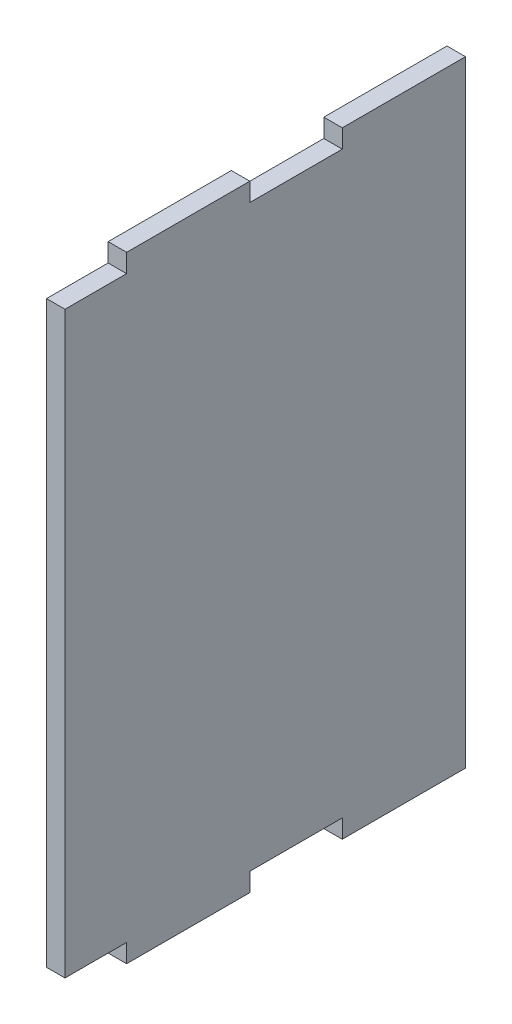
ISO-10303-21;
HEADER;
FILE_DESCRIPTION(('STEP AP214'),'2;1');
FILE_NAME('part.step','',(''),(''),'','','');
FILE_SCHEMA(('AUTOMOTIVE_DESIGN { 1 0 10303 214 1 1 1 1 }'));
ENDSEC;
DATA;
#1=APPLICATION_CONTEXT('core data for automotive mechanical design processes');
#2=APPLICATION_PROTOCOL_DEFINITION('international standard','automotive_design',2000,#1);
#3=PRODUCT_CONTEXT('',#1,'mechanical');
#4=PRODUCT('Part','Part','',(#3));
#5=PRODUCT_RELATED_PRODUCT_CATEGORY('part','',(#4));
#6=PRODUCT_DEFINITION_FORMATION('','',#4);
#7=PRODUCT_DEFINITION_CONTEXT('part definition',#1,'design');
#8=PRODUCT_DEFINITION('design','',#6,#7);
#9=PRODUCT_DEFINITION_SHAPE('','',#8);
#10=(LENGTH_UNIT() NAMED_UNIT(*) SI_UNIT(.MILLI.,.METRE.));
#11=(NAMED_UNIT(*) PLANE_ANGLE_UNIT() SI_UNIT($,.RADIAN.));
#12=(NAMED_UNIT(*) SI_UNIT($,.STERADIAN.) SOLID_ANGLE_UNIT());
#13=UNCERTAINTY_MEASURE_WITH_UNIT(LENGTH_MEASURE(1.E-05),#10,'distance_accuracy_value','');
#14=(GEOMETRIC_REPRESENTATION_CONTEXT(3) GLOBAL_UNCERTAINTY_ASSIGNED_CONTEXT((#13)) GLOBAL_UNIT_ASSIGNED_CONTEXT((#10,
#11,#12)) REPRESENTATION_CONTEXT('',''));
#15=CARTESIAN_POINT('',(0.,0.,0.));
#16=DIRECTION('',(0.,0.,1.));
#17=DIRECTION('',(1.,0.,0.));
#18=AXIS2_PLACEMENT_3D('',#15,#16,#17);
#19=CARTESIAN_POINT('',(3.,59.2776000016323,-2.92664964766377));
#20=DIRECTION('',(0.,-1.,0.));
#21=DIRECTION('',(0.,0.,-1.));
#22=AXIS2_PLACEMENT_3D('',#19,#20,#21);
#23=PLANE('',#22);
#24=DIRECTION('',(0.,0.,1.));
#25=VECTOR('',#24,1.);
#26=CARTESIAN_POINT('',(0.,59.2776000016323,-2.92664964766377));
#27=LINE('',#26,#25);
#28=CARTESIAN_POINT('',(0.,59.2776000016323,-2.92664964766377));
#29=VERTEX_POINT('',#28);
#30=CARTESIAN_POINT('',(0.,59.2776000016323,17.0733503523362));
#31=VERTEX_POINT('',#30);
#32=EDGE_CURVE('E253',#29,#31,#27,.T.);
#33=ORIENTED_EDGE('',*,*,#32,.T.);
#34=DIRECTION('',(1.,0.,0.));
#35=VECTOR('',#34,1.);
#36=CARTESIAN_POINT('',(0.,59.2776000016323,17.0733503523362));
#37=LINE('',#36,#35);
#38=CARTESIAN_POINT('',(3.,59.2776000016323,17.0733503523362));
#39=VERTEX_POINT('',#38);
#40=EDGE_CURVE('E193',#31,#39,#37,.T.);
#41=ORIENTED_EDGE('',*,*,#40,.T.);
#42=DIRECTION('',(0.,0.,1.));
#43=VECTOR('',#42,1.);
#44=CARTESIAN_POINT('',(3.,59.2776000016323,-2.92664964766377));
#45=LINE('',#44,#43);
#46=CARTESIAN_POINT('',(3.,59.2776000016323,-2.92664964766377));
#47=VERTEX_POINT('',#46);
#48=EDGE_CURVE('E241',#47,#39,#45,.T.);
#49=ORIENTED_EDGE('',*,*,#48,.F.);
#50=DIRECTION('',(-1.,0.,0.));
#51=VECTOR('',#50,1.);
#52=CARTESIAN_POINT('',(3.,59.2776000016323,-2.92664964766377));
#53=LINE('',#52,#51);
#54=EDGE_CURVE('E40',#47,#29,#53,.T.);
#55=ORIENTED_EDGE('',*,*,#54,.T.);
#56=EDGE_LOOP('',(#33,#41,#49,#55));
#57=FACE_BOUND('',#56,.T.);
#58=ADVANCED_FACE('F32',(#57),#23,.F.);
#59=CARTESIAN_POINT('',(3.,-40.7223999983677,62.0733503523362));
#60=DIRECTION('',(0.,1.,0.));
#61=DIRECTION('',(0.,0.,1.));
#62=AXIS2_PLACEMENT_3D('',#59,#60,#61);
#63=PLANE('',#62);
#64=DIRECTION('',(0.,0.,-1.));
#65=VECTOR('',#64,1.);
#66=CARTESIAN_POINT('',(3.,-40.7223999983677,62.0733503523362));
#67=LINE('',#66,#65);
#68=CARTESIAN_POINT('',(3.,-40.7223999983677,17.0733503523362));
#69=VERTEX_POINT('',#68);
#70=CARTESIAN_POINT('',(3.,-40.7223999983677,-2.92664964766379));
#71=VERTEX_POINT('',#70);
#72=EDGE_CURVE('E248',#69,#71,#67,.T.);
#73=ORIENTED_EDGE('',*,*,#72,.F.);
#74=DIRECTION('',(1.,0.,0.));
#75=VECTOR('',#74,1.);
#76=CARTESIAN_POINT('',(0.,-40.7223999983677,17.0733503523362));
#77=LINE('',#76,#75);
#78=CARTESIAN_POINT('',(0.,-40.7223999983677,17.0733503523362));
#79=VERTEX_POINT('',#78);
#80=EDGE_CURVE('E182',#79,#69,#77,.T.);
#81=ORIENTED_EDGE('',*,*,#80,.F.);
#82=DIRECTION('',(0.,0.,-1.));
#83=VECTOR('',#82,1.);
#84=CARTESIAN_POINT('',(0.,-40.7223999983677,62.0733503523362));
#85=LINE('',#84,#83);
#86=CARTESIAN_POINT('',(0.,-40.7223999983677,-2.92664964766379));
#87=VERTEX_POINT('',#86);
#88=EDGE_CURVE('E259',#79,#87,#85,.T.);
#89=ORIENTED_EDGE('',*,*,#88,.T.);
#90=DIRECTION('',(-1.,0.,0.));
#91=VECTOR('',#90,1.);
#92=CARTESIAN_POINT('',(3.,-40.7223999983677,-2.92664964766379));
#93=LINE('',#92,#91);
#94=EDGE_CURVE('E11',#71,#87,#93,.T.);
#95=ORIENTED_EDGE('',*,*,#94,.F.);
#96=EDGE_LOOP('',(#73,#81,#89,#95));
#97=FACE_BOUND('',#96,.T.);
#98=ADVANCED_FACE('F284',(#97),#63,.F.);
#99=CARTESIAN_POINT('',(0.,59.2776000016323,32.0733503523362));
#100=VERTEX_POINT('',#99);
#101=CARTESIAN_POINT('',(0.,59.2776000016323,52.0733503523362));
#102=VERTEX_POINT('',#101);
#103=EDGE_CURVE('E237',#100,#102,#27,.T.);
#104=ORIENTED_EDGE('',*,*,#103,.T.);
#105=DIRECTION('',(1.,0.,0.));
#106=VECTOR('',#105,1.);
#107=CARTESIAN_POINT('',(0.,59.2776000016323,52.0733503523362));
#108=LINE('',#107,#106);
#109=CARTESIAN_POINT('',(3.,59.2776000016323,52.0733503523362));
#110=VERTEX_POINT('',#109);
#111=EDGE_CURVE('E213',#102,#110,#108,.T.);
#112=ORIENTED_EDGE('',*,*,#111,.T.);
#113=CARTESIAN_POINT('',(3.,59.2776000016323,32.0733503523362));
#114=VERTEX_POINT('',#113);
#115=EDGE_CURVE('E245',#114,#110,#45,.T.);
#116=ORIENTED_EDGE('',*,*,#115,.F.);
#117=DIRECTION('',(1.,0.,0.));
#118=VECTOR('',#117,1.);
#119=CARTESIAN_POINT('',(0.,59.2776000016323,32.0733503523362));
#120=LINE('',#119,#118);
#121=EDGE_CURVE('E205',#100,#114,#120,.T.);
#122=ORIENTED_EDGE('',*,*,#121,.F.);
#123=EDGE_LOOP('',(#104,#112,#116,#122));
#124=FACE_BOUND('',#123,.T.);
#125=ADVANCED_FACE('F34',(#124),#23,.F.);
#126=CARTESIAN_POINT('',(3.,59.2776000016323,62.0733503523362));
#127=DIRECTION('',(0.,0.,-1.));
#128=DIRECTION('',(-1.,0.,0.));
#129=AXIS2_PLACEMENT_3D('',#126,#127,#128);
#130=PLANE('',#129);
#131=DIRECTION('',(0.,-1.,0.));
#132=VECTOR('',#131,1.);
#133=CARTESIAN_POINT('',(3.,59.2776000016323,62.0733503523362));
#134=LINE('',#133,#132);
#135=CARTESIAN_POINT('',(3.,56.2776000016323,62.0733503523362));
#136=VERTEX_POINT('',#135);
#137=CARTESIAN_POINT('',(3.,-37.7223999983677,62.0733503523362));
#138=VERTEX_POINT('',#137);
#139=EDGE_CURVE('E244',#136,#138,#134,.T.);
#140=ORIENTED_EDGE('',*,*,#139,.F.);
#141=DIRECTION('',(1.,0.,0.));
#142=VECTOR('',#141,1.);
#143=CARTESIAN_POINT('',(0.,56.2776000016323,62.0733503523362));
#144=LINE('',#143,#142);
#145=CARTESIAN_POINT('',(0.,56.2776000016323,62.0733503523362));
#146=VERTEX_POINT('',#145);
#147=EDGE_CURVE('E219',#146,#136,#144,.T.);
#148=ORIENTED_EDGE('',*,*,#147,.F.);
#149=DIRECTION('',(0.,-1.,0.));
#150=VECTOR('',#149,1.);
#151=CARTESIAN_POINT('',(0.,59.2776000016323,62.0733503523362));
#152=LINE('',#151,#150);
#153=CARTESIAN_POINT('',(0.,-37.7223999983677,62.0733503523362));
#154=VERTEX_POINT('',#153);
#155=EDGE_CURVE('E256',#146,#154,#152,.T.);
#156=ORIENTED_EDGE('',*,*,#155,.T.);
#157=DIRECTION('',(1.,0.,0.));
#158=VECTOR('',#157,1.);
#159=CARTESIAN_POINT('',(0.,-37.7223999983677,62.0733503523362));
#160=LINE('',#159,#158);
#161=EDGE_CURVE('E234',#154,#138,#160,.T.);
#162=ORIENTED_EDGE('',*,*,#161,.T.);
#163=EDGE_LOOP('',(#140,#148,#156,#162));
#164=FACE_BOUND('',#163,.T.);
#165=ADVANCED_FACE('F303',(#164),#130,.F.);
#166=CARTESIAN_POINT('',(0.,-40.7223999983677,52.0733503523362));
#167=VERTEX_POINT('',#166);
#168=CARTESIAN_POINT('',(0.,-40.7223999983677,32.0733503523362));
#169=VERTEX_POINT('',#168);
#170=EDGE_CURVE('E261',#167,#169,#85,.T.);
#171=ORIENTED_EDGE('',*,*,#170,.T.);
#172=DIRECTION('',(1.,0.,0.));
#173=VECTOR('',#172,1.);
#174=CARTESIAN_POINT('',(0.,-40.7223999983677,32.0733503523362));
#175=LINE('',#174,#173);
#176=CARTESIAN_POINT('',(3.,-40.7223999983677,32.0733503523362));
#177=VERTEX_POINT('',#176);
#178=EDGE_CURVE('E155',#169,#177,#175,.T.);
#179=ORIENTED_EDGE('',*,*,#178,.T.);
#180=CARTESIAN_POINT('',(3.,-40.7223999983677,52.0733503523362));
#181=VERTEX_POINT('',#180);
#182=EDGE_CURVE('E250',#181,#177,#67,.T.);
#183=ORIENTED_EDGE('',*,*,#182,.F.);
#184=DIRECTION('',(1.,0.,0.));
#185=VECTOR('',#184,1.);
#186=CARTESIAN_POINT('',(0.,-40.7223999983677,52.0733503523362));
#187=LINE('',#186,#185);
#188=EDGE_CURVE('E230',#167,#181,#187,.T.);
#189=ORIENTED_EDGE('',*,*,#188,.F.);
#190=EDGE_LOOP('',(#171,#179,#183,#189));
#191=FACE_BOUND('',#190,.T.);
#192=ADVANCED_FACE('F292',(#191),#63,.F.);
#193=CARTESIAN_POINT('',(3.,-40.7223999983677,-2.92664964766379));
#194=DIRECTION('',(0.,0.,1.));
#195=DIRECTION('',(0.,-1.,0.));
#196=AXIS2_PLACEMENT_3D('',#193,#194,#195);
#197=PLANE('',#196);
#198=DIRECTION('',(0.,1.,0.));
#199=VECTOR('',#198,1.);
#200=CARTESIAN_POINT('',(0.,-40.7223999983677,-2.92664964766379));
#201=LINE('',#200,#199);
#202=EDGE_CURVE('E262',#87,#29,#201,.T.);
#203=ORIENTED_EDGE('',*,*,#202,.T.);
#204=ORIENTED_EDGE('',*,*,#54,.F.);
#205=DIRECTION('',(0.,1.,0.));
#206=VECTOR('',#205,1.);
#207=CARTESIAN_POINT('',(3.,-40.7223999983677,-2.92664964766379));
#208=LINE('',#207,#206);
#209=EDGE_CURVE('E251',#71,#47,#208,.T.);
#210=ORIENTED_EDGE('',*,*,#209,.F.);
#211=ORIENTED_EDGE('',*,*,#94,.T.);
#212=EDGE_LOOP('',(#203,#204,#210,#211));
#213=FACE_BOUND('',#212,.T.);
#214=ADVANCED_FACE('F282',(#213),#197,.F.);
#215=CARTESIAN_POINT('',(3.,0.,0.));
#216=DIRECTION('',(1.,0.,0.));
#217=DIRECTION('',(0.,0.,-1.));
#218=AXIS2_PLACEMENT_3D('',#215,#216,#217);
#219=PLANE('',#218);
#220=DIRECTION('',(0.,1.,0.));
#221=VECTOR('',#220,1.);
#222=CARTESIAN_POINT('',(3.,56.2776000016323,52.0733503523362));
#223=LINE('',#222,#221);
#224=CARTESIAN_POINT('',(3.,56.2776000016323,52.0733503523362));
#225=VERTEX_POINT('',#224);
#226=EDGE_CURVE('E214',#225,#110,#223,.T.);
#227=ORIENTED_EDGE('',*,*,#226,.F.);
#228=DIRECTION('',(0.,0.,-1.));
#229=VECTOR('',#228,1.);
#230=CARTESIAN_POINT('',(3.,56.2776000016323,62.0733503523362));
#231=LINE('',#230,#229);
#232=EDGE_CURVE('E211',#136,#225,#231,.T.);
#233=ORIENTED_EDGE('',*,*,#232,.F.);
#234=ORIENTED_EDGE('',*,*,#139,.T.);
#235=DIRECTION('',(0.,0.,1.));
#236=VECTOR('',#235,1.);
#237=CARTESIAN_POINT('',(3.,-37.7223999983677,62.0733503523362));
#238=LINE('',#237,#236);
#239=CARTESIAN_POINT('',(3.,-37.7223999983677,52.0733503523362));
#240=VERTEX_POINT('',#239);
#241=EDGE_CURVE('E227',#240,#138,#238,.T.);
#242=ORIENTED_EDGE('',*,*,#241,.F.);
#243=DIRECTION('',(0.,1.,0.));
#244=VECTOR('',#243,1.);
#245=CARTESIAN_POINT('',(3.,-37.7223999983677,52.0733503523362));
#246=LINE('',#245,#244);
#247=EDGE_CURVE('E181',#181,#240,#246,.T.);
#248=ORIENTED_EDGE('',*,*,#247,.F.);
#249=ORIENTED_EDGE('',*,*,#182,.T.);
#250=DIRECTION('',(0.,-1.,0.));
#251=VECTOR('',#250,1.);
#252=CARTESIAN_POINT('',(3.,-37.7223999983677,32.0733503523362));
#253=LINE('',#252,#251);
#254=CARTESIAN_POINT('',(3.,-37.7223999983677,32.0733503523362));
#255=VERTEX_POINT('',#254);
#256=EDGE_CURVE('E172',#255,#177,#253,.T.);
#257=ORIENTED_EDGE('',*,*,#256,.F.);
#258=DIRECTION('',(0.,0.,1.));
#259=VECTOR('',#258,1.);
#260=CARTESIAN_POINT('',(3.,-37.7223999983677,17.0733503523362));
#261=LINE('',#260,#259);
#262=CARTESIAN_POINT('',(3.,-37.7223999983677,17.0733503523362));
#263=VERTEX_POINT('',#262);
#264=EDGE_CURVE('E152',#263,#255,#261,.T.);
#265=ORIENTED_EDGE('',*,*,#264,.F.);
#266=DIRECTION('',(0.,1.,0.));
#267=VECTOR('',#266,1.);
#268=CARTESIAN_POINT('',(3.,-40.7223999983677,17.0733503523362));
#269=LINE('',#268,#267);
#270=EDGE_CURVE('E169',#69,#263,#269,.T.);
#271=ORIENTED_EDGE('',*,*,#270,.F.);
#272=ORIENTED_EDGE('',*,*,#72,.T.);
#273=ORIENTED_EDGE('',*,*,#209,.T.);
#274=ORIENTED_EDGE('',*,*,#48,.T.);
#275=DIRECTION('',(0.,1.,0.));
#276=VECTOR('',#275,1.);
#277=CARTESIAN_POINT('',(3.,59.2776000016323,17.0733503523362));
#278=LINE('',#277,#276);
#279=CARTESIAN_POINT('',(3.,56.2776000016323,17.0733503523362));
#280=VERTEX_POINT('',#279);
#281=EDGE_CURVE('E194',#280,#39,#278,.T.);
#282=ORIENTED_EDGE('',*,*,#281,.F.);
#283=DIRECTION('',(0.,0.,-1.));
#284=VECTOR('',#283,1.);
#285=CARTESIAN_POINT('',(3.,56.2776000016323,17.0733503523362));
#286=LINE('',#285,#284);
#287=CARTESIAN_POINT('',(3.,56.2776000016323,32.0733503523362));
#288=VERTEX_POINT('',#287);
#289=EDGE_CURVE('E189',#288,#280,#286,.T.);
#290=ORIENTED_EDGE('',*,*,#289,.F.);
#291=DIRECTION('',(0.,-1.,0.));
#292=VECTOR('',#291,1.);
#293=CARTESIAN_POINT('',(3.,56.2776000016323,32.0733503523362));
#294=LINE('',#293,#292);
#295=EDGE_CURVE('E196',#114,#288,#294,.T.);
#296=ORIENTED_EDGE('',*,*,#295,.F.);
#297=ORIENTED_EDGE('',*,*,#115,.T.);
#298=EDGE_LOOP('',(#227,#233,#234,#242,#248,#249,#257,#265,#271,#272,#273,#274,#282,#290,#296,#297));
#299=FACE_BOUND('',#298,.T.);
#300=ADVANCED_FACE('F277',(#299),#219,.T.);
#301=CARTESIAN_POINT('',(0.,0.,0.));
#302=DIRECTION('',(1.,0.,0.));
#303=DIRECTION('',(0.,0.,-1.));
#304=AXIS2_PLACEMENT_3D('',#301,#302,#303);
#305=PLANE('',#304);
#306=DIRECTION('',(0.,0.,-1.));
#307=VECTOR('',#306,1.);
#308=CARTESIAN_POINT('',(0.,56.2776000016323,62.0733503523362));
#309=LINE('',#308,#307);
#310=CARTESIAN_POINT('',(0.,56.2776000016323,52.0733503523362));
#311=VERTEX_POINT('',#310);
#312=EDGE_CURVE('E210',#146,#311,#309,.T.);
#313=ORIENTED_EDGE('',*,*,#312,.T.);
#314=DIRECTION('',(0.,1.,0.));
#315=VECTOR('',#314,1.);
#316=CARTESIAN_POINT('',(0.,56.2776000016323,52.0733503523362));
#317=LINE('',#316,#315);
#318=EDGE_CURVE('E47',#311,#102,#317,.T.);
#319=ORIENTED_EDGE('',*,*,#318,.T.);
#320=ORIENTED_EDGE('',*,*,#103,.F.);
#321=DIRECTION('',(0.,-1.,0.));
#322=VECTOR('',#321,1.);
#323=CARTESIAN_POINT('',(0.,56.2776000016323,32.0733503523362));
#324=LINE('',#323,#322);
#325=CARTESIAN_POINT('',(0.,56.2776000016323,32.0733503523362));
#326=VERTEX_POINT('',#325);
#327=EDGE_CURVE('E188',#100,#326,#324,.T.);
#328=ORIENTED_EDGE('',*,*,#327,.T.);
#329=DIRECTION('',(0.,0.,-1.));
#330=VECTOR('',#329,1.);
#331=CARTESIAN_POINT('',(0.,56.2776000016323,17.0733503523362));
#332=LINE('',#331,#330);
#333=CARTESIAN_POINT('',(0.,56.2776000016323,17.0733503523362));
#334=VERTEX_POINT('',#333);
#335=EDGE_CURVE('E55',#326,#334,#332,.T.);
#336=ORIENTED_EDGE('',*,*,#335,.T.);
#337=DIRECTION('',(0.,1.,0.));
#338=VECTOR('',#337,1.);
#339=CARTESIAN_POINT('',(0.,59.2776000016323,17.0733503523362));
#340=LINE('',#339,#338);
#341=EDGE_CURVE('E185',#334,#31,#340,.T.);
#342=ORIENTED_EDGE('',*,*,#341,.T.);
#343=ORIENTED_EDGE('',*,*,#32,.F.);
#344=ORIENTED_EDGE('',*,*,#202,.F.);
#345=ORIENTED_EDGE('',*,*,#88,.F.);
#346=DIRECTION('',(0.,1.,0.));
#347=VECTOR('',#346,1.);
#348=CARTESIAN_POINT('',(0.,-40.7223999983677,17.0733503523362));
#349=LINE('',#348,#347);
#350=CARTESIAN_POINT('',(0.,-37.7223999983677,17.0733503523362));
#351=VERTEX_POINT('',#350);
#352=EDGE_CURVE('E156',#79,#351,#349,.T.);
#353=ORIENTED_EDGE('',*,*,#352,.T.);
#354=DIRECTION('',(0.,0.,1.));
#355=VECTOR('',#354,1.);
#356=CARTESIAN_POINT('',(0.,-37.7223999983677,17.0733503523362));
#357=LINE('',#356,#355);
#358=CARTESIAN_POINT('',(0.,-37.7223999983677,32.0733503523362));
#359=VERTEX_POINT('',#358);
#360=EDGE_CURVE('E149',#351,#359,#357,.T.);
#361=ORIENTED_EDGE('',*,*,#360,.T.);
#362=DIRECTION('',(0.,-1.,0.));
#363=VECTOR('',#362,1.);
#364=CARTESIAN_POINT('',(0.,-37.7223999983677,32.0733503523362));
#365=LINE('',#364,#363);
#366=EDGE_CURVE('E159',#359,#169,#365,.T.);
#367=ORIENTED_EDGE('',*,*,#366,.T.);
#368=ORIENTED_EDGE('',*,*,#170,.F.);
#369=DIRECTION('',(0.,1.,0.));
#370=VECTOR('',#369,1.);
#371=CARTESIAN_POINT('',(0.,-37.7223999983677,52.0733503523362));
#372=LINE('',#371,#370);
#373=CARTESIAN_POINT('',(0.,-37.7223999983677,52.0733503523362));
#374=VERTEX_POINT('',#373);
#375=EDGE_CURVE('E223',#167,#374,#372,.T.);
#376=ORIENTED_EDGE('',*,*,#375,.T.);
#377=DIRECTION('',(0.,0.,1.));
#378=VECTOR('',#377,1.);
#379=CARTESIAN_POINT('',(0.,-37.7223999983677,62.0733503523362));
#380=LINE('',#379,#378);
#381=EDGE_CURVE('E226',#374,#154,#380,.T.);
#382=ORIENTED_EDGE('',*,*,#381,.T.);
#383=ORIENTED_EDGE('',*,*,#155,.F.);
#384=EDGE_LOOP('',(#313,#319,#320,#328,#336,#342,#343,#344,#345,#353,#361,#367,#368,#376,#382,#383));
#385=FACE_BOUND('',#384,.T.);
#386=ADVANCED_FACE('F167',(#385),#305,.F.);
#387=CARTESIAN_POINT('',(0.,-37.7223999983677,62.0733503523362));
#388=DIRECTION('',(0.,1.,0.));
#389=DIRECTION('',(0.,0.,1.));
#390=AXIS2_PLACEMENT_3D('',#387,#388,#389);
#391=PLANE('',#390);
#392=ORIENTED_EDGE('',*,*,#241,.T.);
#393=ORIENTED_EDGE('',*,*,#161,.F.);
#394=ORIENTED_EDGE('',*,*,#381,.F.);
#395=DIRECTION('',(1.,0.,0.));
#396=VECTOR('',#395,1.);
#397=CARTESIAN_POINT('',(0.,-37.7223999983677,52.0733503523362));
#398=LINE('',#397,#396);
#399=EDGE_CURVE('E238',#374,#240,#398,.T.);
#400=ORIENTED_EDGE('',*,*,#399,.T.);
#401=EDGE_LOOP('',(#392,#393,#394,#400));
#402=FACE_BOUND('',#401,.T.);
#403=ADVANCED_FACE('F300',(#402),#391,.F.);
#404=CARTESIAN_POINT('',(0.,-37.7223999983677,52.0733503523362));
#405=DIRECTION('',(0.,0.,-1.));
#406=DIRECTION('',(-1.,0.,0.));
#407=AXIS2_PLACEMENT_3D('',#404,#405,#406);
#408=PLANE('',#407);
#409=ORIENTED_EDGE('',*,*,#247,.T.);
#410=ORIENTED_EDGE('',*,*,#399,.F.);
#411=ORIENTED_EDGE('',*,*,#375,.F.);
#412=ORIENTED_EDGE('',*,*,#188,.T.);
#413=EDGE_LOOP('',(#409,#410,#411,#412));
#414=FACE_BOUND('',#413,.T.);
#415=ADVANCED_FACE('F297',(#414),#408,.F.);
#416=CARTESIAN_POINT('',(0.,-37.7223999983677,17.0733503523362));
#417=DIRECTION('',(0.,1.,0.));
#418=DIRECTION('',(0.,0.,1.));
#419=AXIS2_PLACEMENT_3D('',#416,#417,#418);
#420=PLANE('',#419);
#421=ORIENTED_EDGE('',*,*,#264,.T.);
#422=DIRECTION('',(1.,0.,0.));
#423=VECTOR('',#422,1.);
#424=CARTESIAN_POINT('',(0.,-37.7223999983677,32.0733503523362));
#425=LINE('',#424,#423);
#426=EDGE_CURVE('E145',#359,#255,#425,.T.);
#427=ORIENTED_EDGE('',*,*,#426,.F.);
#428=ORIENTED_EDGE('',*,*,#360,.F.);
#429=DIRECTION('',(1.,0.,0.));
#430=VECTOR('',#429,1.);
#431=CARTESIAN_POINT('',(0.,-37.7223999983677,17.0733503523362));
#432=LINE('',#431,#430);
#433=EDGE_CURVE('E179',#351,#263,#432,.T.);
#434=ORIENTED_EDGE('',*,*,#433,.T.);
#435=EDGE_LOOP('',(#421,#427,#428,#434));
#436=FACE_BOUND('',#435,.T.);
#437=ADVANCED_FACE('F147',(#436),#420,.F.);
#438=CARTESIAN_POINT('',(0.,-40.7223999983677,17.0733503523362));
#439=DIRECTION('',(0.,0.,-1.));
#440=DIRECTION('',(-1.,0.,0.));
#441=AXIS2_PLACEMENT_3D('',#438,#439,#440);
#442=PLANE('',#441);
#443=ORIENTED_EDGE('',*,*,#270,.T.);
#444=ORIENTED_EDGE('',*,*,#433,.F.);
#445=ORIENTED_EDGE('',*,*,#352,.F.);
#446=ORIENTED_EDGE('',*,*,#80,.T.);
#447=EDGE_LOOP('',(#443,#444,#445,#446));
#448=FACE_BOUND('',#447,.T.);
#449=ADVANCED_FACE('F287',(#448),#442,.F.);
#450=CARTESIAN_POINT('',(0.,-37.7223999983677,32.0733503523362));
#451=DIRECTION('',(0.,0.,1.));
#452=DIRECTION('',(1.,0.,0.));
#453=AXIS2_PLACEMENT_3D('',#450,#451,#452);
#454=PLANE('',#453);
#455=ORIENTED_EDGE('',*,*,#256,.T.);
#456=ORIENTED_EDGE('',*,*,#178,.F.);
#457=ORIENTED_EDGE('',*,*,#366,.F.);
#458=ORIENTED_EDGE('',*,*,#426,.T.);
#459=EDGE_LOOP('',(#455,#456,#457,#458));
#460=FACE_BOUND('',#459,.T.);
#461=ADVANCED_FACE('F160',(#460),#454,.F.);
#462=CARTESIAN_POINT('',(0.,59.2776000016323,17.0733503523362));
#463=DIRECTION('',(0.,0.,-1.));
#464=DIRECTION('',(-1.,0.,0.));
#465=AXIS2_PLACEMENT_3D('',#462,#463,#464);
#466=PLANE('',#465);
#467=ORIENTED_EDGE('',*,*,#281,.T.);
#468=ORIENTED_EDGE('',*,*,#40,.F.);
#469=ORIENTED_EDGE('',*,*,#341,.F.);
#470=DIRECTION('',(1.,0.,0.));
#471=VECTOR('',#470,1.);
#472=CARTESIAN_POINT('',(0.,56.2776000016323,17.0733503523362));
#473=LINE('',#472,#471);
#474=EDGE_CURVE('E177',#334,#280,#473,.T.);
#475=ORIENTED_EDGE('',*,*,#474,.T.);
#476=EDGE_LOOP('',(#467,#468,#469,#475));
#477=FACE_BOUND('',#476,.T.);
#478=ADVANCED_FACE('F273',(#477),#466,.F.);
#479=CARTESIAN_POINT('',(0.,56.2776000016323,17.0733503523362));
#480=DIRECTION('',(0.,-1.,0.));
#481=DIRECTION('',(0.,0.,-1.));
#482=AXIS2_PLACEMENT_3D('',#479,#480,#481);
#483=PLANE('',#482);
#484=ORIENTED_EDGE('',*,*,#289,.T.);
#485=ORIENTED_EDGE('',*,*,#474,.F.);
#486=ORIENTED_EDGE('',*,*,#335,.F.);
#487=DIRECTION('',(1.,0.,0.));
#488=VECTOR('',#487,1.);
#489=CARTESIAN_POINT('',(0.,56.2776000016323,32.0733503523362));
#490=LINE('',#489,#488);
#491=EDGE_CURVE('E203',#326,#288,#490,.T.);
#492=ORIENTED_EDGE('',*,*,#491,.T.);
#493=EDGE_LOOP('',(#484,#485,#486,#492));
#494=FACE_BOUND('',#493,.T.);
#495=ADVANCED_FACE('F317',(#494),#483,.F.);
#496=CARTESIAN_POINT('',(0.,56.2776000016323,32.0733503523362));
#497=DIRECTION('',(0.,0.,1.));
#498=DIRECTION('',(1.,0.,0.));
#499=AXIS2_PLACEMENT_3D('',#496,#497,#498);
#500=PLANE('',#499);
#501=ORIENTED_EDGE('',*,*,#295,.T.);
#502=ORIENTED_EDGE('',*,*,#491,.F.);
#503=ORIENTED_EDGE('',*,*,#327,.F.);
#504=ORIENTED_EDGE('',*,*,#121,.T.);
#505=EDGE_LOOP('',(#501,#502,#503,#504));
#506=FACE_BOUND('',#505,.T.);
#507=ADVANCED_FACE('F316',(#506),#500,.F.);
#508=CARTESIAN_POINT('',(0.,56.2776000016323,52.0733503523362));
#509=DIRECTION('',(0.,0.,-1.));
#510=DIRECTION('',(-1.,0.,0.));
#511=AXIS2_PLACEMENT_3D('',#508,#509,#510);
#512=PLANE('',#511);
#513=ORIENTED_EDGE('',*,*,#226,.T.);
#514=ORIENTED_EDGE('',*,*,#111,.F.);
#515=ORIENTED_EDGE('',*,*,#318,.F.);
#516=DIRECTION('',(1.,0.,0.));
#517=VECTOR('',#516,1.);
#518=CARTESIAN_POINT('',(0.,56.2776000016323,52.0733503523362));
#519=LINE('',#518,#517);
#520=EDGE_CURVE('E197',#311,#225,#519,.T.);
#521=ORIENTED_EDGE('',*,*,#520,.T.);
#522=EDGE_LOOP('',(#513,#514,#515,#521));
#523=FACE_BOUND('',#522,.T.);
#524=ADVANCED_FACE('F324',(#523),#512,.F.);
#525=CARTESIAN_POINT('',(0.,56.2776000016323,62.0733503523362));
#526=DIRECTION('',(0.,-1.,0.));
#527=DIRECTION('',(0.,0.,-1.));
#528=AXIS2_PLACEMENT_3D('',#525,#526,#527);
#529=PLANE('',#528);
#530=ORIENTED_EDGE('',*,*,#232,.T.);
#531=ORIENTED_EDGE('',*,*,#520,.F.);
#532=ORIENTED_EDGE('',*,*,#312,.F.);
#533=ORIENTED_EDGE('',*,*,#147,.T.);
#534=EDGE_LOOP('',(#530,#531,#532,#533));
#535=FACE_BOUND('',#534,.T.);
#536=ADVANCED_FACE('F308',(#535),#529,.F.);
#537=CLOSED_SHELL('',(#58,#98,#125,#165,#192,#214,#300,#386,#403,#415,#437,#449,#461,#478,#495,
#507,#524,#536));
#538=MANIFOLD_SOLID_BREP('B2',#537);
#539=ADVANCED_BREP_SHAPE_REPRESENTATION('',(#18,#538),#14);
#540=SHAPE_DEFINITION_REPRESENTATION(#9,#539);
ENDSEC;
END-ISO-10303-21;
